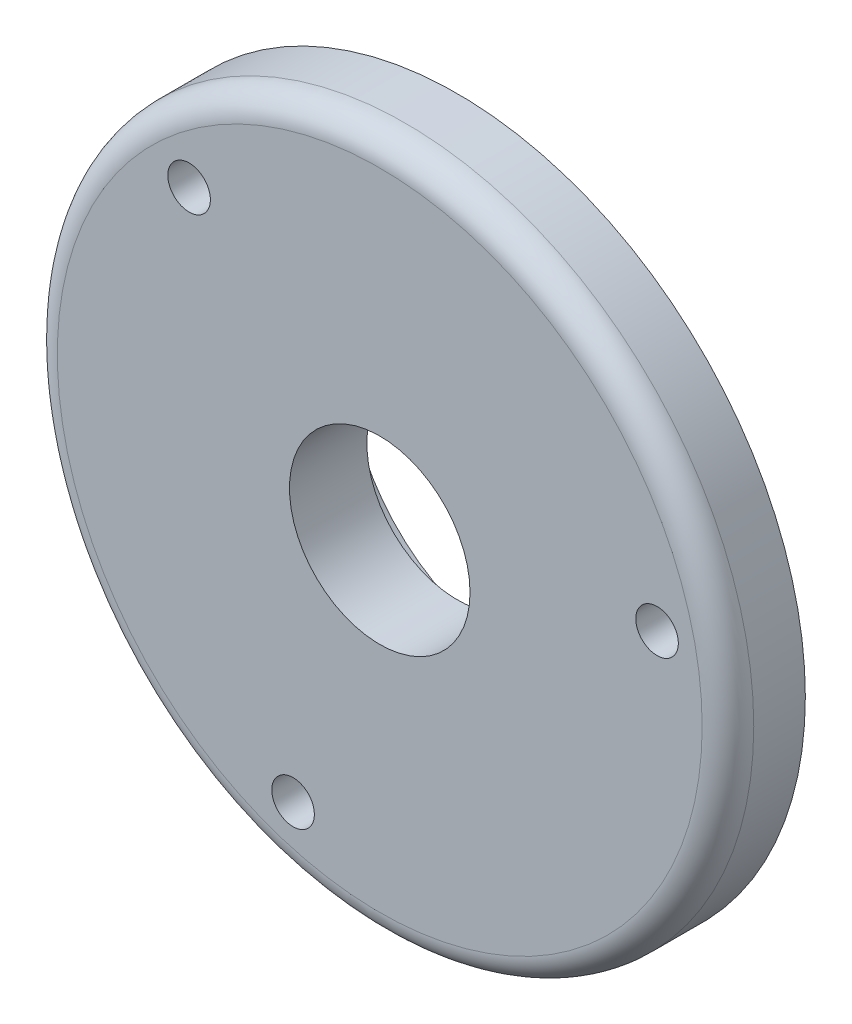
ISO-10303-21;
HEADER;
FILE_DESCRIPTION(('STEP AP214'),'2;1');
FILE_NAME('part.step','',(''),(''),'','','');
FILE_SCHEMA(('AUTOMOTIVE_DESIGN { 1 0 10303 214 1 1 1 1 }'));
ENDSEC;
DATA;
#1=APPLICATION_CONTEXT('core data for automotive mechanical design processes');
#2=APPLICATION_PROTOCOL_DEFINITION('international standard','automotive_design',2000,#1);
#3=PRODUCT_CONTEXT('',#1,'mechanical');
#4=PRODUCT('Part','Part','',(#3));
#5=PRODUCT_RELATED_PRODUCT_CATEGORY('part','',(#4));
#6=PRODUCT_DEFINITION_FORMATION('','',#4);
#7=PRODUCT_DEFINITION_CONTEXT('part definition',#1,'design');
#8=PRODUCT_DEFINITION('design','',#6,#7);
#9=PRODUCT_DEFINITION_SHAPE('','',#8);
#10=(LENGTH_UNIT() NAMED_UNIT(*) SI_UNIT(.MILLI.,.METRE.));
#11=(NAMED_UNIT(*) PLANE_ANGLE_UNIT() SI_UNIT($,.RADIAN.));
#12=(NAMED_UNIT(*) SI_UNIT($,.STERADIAN.) SOLID_ANGLE_UNIT());
#13=UNCERTAINTY_MEASURE_WITH_UNIT(LENGTH_MEASURE(1.E-05),#10,'distance_accuracy_value','');
#14=(GEOMETRIC_REPRESENTATION_CONTEXT(3) GLOBAL_UNCERTAINTY_ASSIGNED_CONTEXT((#13)) GLOBAL_UNIT_ASSIGNED_CONTEXT((#10,
#11,#12)) REPRESENTATION_CONTEXT('',''));
#15=CARTESIAN_POINT('',(0.,0.,0.));
#16=DIRECTION('',(0.,0.,1.));
#17=DIRECTION('',(1.,0.,0.));
#18=AXIS2_PLACEMENT_3D('',#15,#16,#17);
#19=CARTESIAN_POINT('',(0.,0.,57.4974746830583));
#20=DIRECTION('',(0.,0.,-1.));
#21=DIRECTION('',(-1.,0.,0.));
#22=AXIS2_PLACEMENT_3D('',#19,#20,#21);
#23=CYLINDRICAL_SURFACE('',#22,17.5);
#24=CARTESIAN_POINT('',(0.,0.,1.25000000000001));
#25=DIRECTION('',(0.,0.,1.));
#26=DIRECTION('',(1.,0.,0.));
#27=AXIS2_PLACEMENT_3D('',#24,#25,#26);
#28=CIRCLE('',#27,17.5);
#29=CARTESIAN_POINT('',(17.5,0.,1.25000000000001));
#30=VERTEX_POINT('',#29);
#31=EDGE_CURVE('E44',#30,#30,#28,.T.);
#32=ORIENTED_EDGE('',*,*,#31,.T.);
#33=EDGE_LOOP('',(#32));
#34=FACE_BOUND('',#33,.T.);
#35=CARTESIAN_POINT('',(0.,0.,5.99999999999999));
#36=DIRECTION('',(0.,0.,1.));
#37=DIRECTION('',(1.,0.,0.));
#38=AXIS2_PLACEMENT_3D('',#35,#36,#37);
#39=CIRCLE('',#38,17.5);
#40=CARTESIAN_POINT('',(17.5,0.,6.));
#41=VERTEX_POINT('',#40);
#42=EDGE_CURVE('E40',#41,#41,#39,.T.);
#43=ORIENTED_EDGE('',*,*,#42,.F.);
#44=EDGE_LOOP('',(#43));
#45=FACE_BOUND('',#44,.T.);
#46=ADVANCED_FACE('F29',(#34,#45),#23,.T.);
#47=CARTESIAN_POINT('',(0.,0.,1.25000000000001));
#48=DIRECTION('',(0.,0.,1.));
#49=DIRECTION('',(1.,0.,0.));
#50=AXIS2_PLACEMENT_3D('',#47,#48,#49);
#51=PLANE('',#50);
#52=ORIENTED_EDGE('',*,*,#31,.F.);
#53=EDGE_LOOP('',(#52));
#54=FACE_BOUND('',#53,.T.);
#55=CARTESIAN_POINT('',(0.,0.,1.25000000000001));
#56=DIRECTION('',(0.,0.,1.));
#57=DIRECTION('',(1.,0.,0.));
#58=AXIS2_PLACEMENT_3D('',#55,#56,#57);
#59=CIRCLE('',#58,13.204);
#60=CARTESIAN_POINT('',(13.204,0.,1.25000000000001));
#61=VERTEX_POINT('',#60);
#62=EDGE_CURVE('E49',#61,#61,#59,.T.);
#63=ORIENTED_EDGE('',*,*,#62,.T.);
#64=EDGE_LOOP('',(#63));
#65=FACE_BOUND('',#64,.T.);
#66=ADVANCED_FACE('F118',(#54,#65),#51,.F.);
#67=CARTESIAN_POINT('',(0.,0.,57.4974746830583));
#68=DIRECTION('',(0.,0.,-1.));
#69=DIRECTION('',(-1.,0.,0.));
#70=AXIS2_PLACEMENT_3D('',#67,#68,#69);
#71=CYLINDRICAL_SURFACE('',#70,13.204);
#72=ORIENTED_EDGE('',*,*,#62,.F.);
#73=EDGE_LOOP('',(#72));
#74=FACE_BOUND('',#73,.T.);
#75=CARTESIAN_POINT('',(0.,0.,5.99999999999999));
#76=DIRECTION('',(0.,0.,1.));
#77=DIRECTION('',(1.,0.,0.));
#78=AXIS2_PLACEMENT_3D('',#75,#76,#77);
#79=CIRCLE('',#78,13.204);
#80=CARTESIAN_POINT('',(13.204,0.,5.99999999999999));
#81=VERTEX_POINT('',#80);
#82=EDGE_CURVE('E51',#81,#81,#79,.T.);
#83=ORIENTED_EDGE('',*,*,#82,.T.);
#84=EDGE_LOOP('',(#83));
#85=FACE_BOUND('',#84,.T.);
#86=ADVANCED_FACE('F115',(#74,#85),#71,.F.);
#87=CARTESIAN_POINT('',(0.,0.,5.99999999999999));
#88=DIRECTION('',(0.,0.,1.));
#89=DIRECTION('',(1.,0.,0.));
#90=AXIS2_PLACEMENT_3D('',#87,#88,#89);
#91=PLANE('',#90);
#92=CARTESIAN_POINT('',(-6.72018364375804,-20.9484875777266,5.99999999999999));
#93=DIRECTION('',(0.,0.,1.));
#94=DIRECTION('',(1.,0.,0.));
#95=AXIS2_PLACEMENT_3D('',#92,#93,#94);
#96=CIRCLE('',#95,1.64999999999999);
#97=CARTESIAN_POINT('',(-5.07018364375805,-20.9484875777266,5.99999999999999));
#98=VERTEX_POINT('',#97);
#99=EDGE_CURVE('E76',#98,#98,#96,.T.);
#100=ORIENTED_EDGE('',*,*,#99,.T.);
#101=EDGE_LOOP('',(#100));
#102=FACE_BOUND('',#101,.T.);
#103=CARTESIAN_POINT('',(-14.7818305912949,16.2940935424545,5.99999999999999));
#104=DIRECTION('',(0.,0.,1.));
#105=DIRECTION('',(1.,0.,0.));
#106=AXIS2_PLACEMENT_3D('',#103,#104,#105);
#107=CIRCLE('',#106,1.64999999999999);
#108=CARTESIAN_POINT('',(-13.1318305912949,16.2940935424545,5.99999999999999));
#109=VERTEX_POINT('',#108);
#110=EDGE_CURVE('E70',#109,#109,#107,.T.);
#111=ORIENTED_EDGE('',*,*,#110,.T.);
#112=EDGE_LOOP('',(#111));
#113=FACE_BOUND('',#112,.T.);
#114=CARTESIAN_POINT('',(21.502014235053,4.65439403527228,5.99999999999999));
#115=DIRECTION('',(0.,0.,1.));
#116=DIRECTION('',(1.,0.,0.));
#117=AXIS2_PLACEMENT_3D('',#114,#115,#116);
#118=CIRCLE('',#117,1.64999999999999);
#119=CARTESIAN_POINT('',(23.152014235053,4.65439403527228,5.99999999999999));
#120=VERTEX_POINT('',#119);
#121=EDGE_CURVE('E62',#120,#120,#118,.T.);
#122=ORIENTED_EDGE('',*,*,#121,.T.);
#123=EDGE_LOOP('',(#122));
#124=FACE_BOUND('',#123,.T.);
#125=CARTESIAN_POINT('',(0.,0.,5.99999999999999));
#126=DIRECTION('',(0.,0.,1.));
#127=DIRECTION('',(1.,0.,0.));
#128=AXIS2_PLACEMENT_3D('',#125,#126,#127);
#129=CIRCLE('',#128,27.);
#130=CARTESIAN_POINT('',(27.,0.,5.99999999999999));
#131=VERTEX_POINT('',#130);
#132=EDGE_CURVE('E55',#131,#131,#129,.T.);
#133=ORIENTED_EDGE('',*,*,#132,.F.);
#134=EDGE_LOOP('',(#133));
#135=FACE_BOUND('',#134,.T.);
#136=ORIENTED_EDGE('',*,*,#42,.T.);
#137=EDGE_LOOP('',(#136));
#138=FACE_BOUND('',#137,.T.);
#139=ADVANCED_FACE('F90',(#102,#113,#124,#135,#138),#91,.F.);
#140=CARTESIAN_POINT('',(0.,0.,12.));
#141=DIRECTION('',(0.,0.,1.));
#142=DIRECTION('',(1.,0.,0.));
#143=AXIS2_PLACEMENT_3D('',#140,#141,#142);
#144=PLANE('',#143);
#145=CARTESIAN_POINT('',(0.,0.,12.));
#146=DIRECTION('',(0.,0.,1.));
#147=DIRECTION('',(1.,0.,0.));
#148=AXIS2_PLACEMENT_3D('',#145,#146,#147);
#149=CIRCLE('',#148,25.);
#150=CARTESIAN_POINT('',(25.,0.,12.));
#151=VERTEX_POINT('',#150);
#152=EDGE_CURVE('E36',#151,#151,#149,.T.);
#153=ORIENTED_EDGE('',*,*,#152,.T.);
#154=EDGE_LOOP('',(#153));
#155=FACE_BOUND('',#154,.T.);
#156=CARTESIAN_POINT('',(-6.72018364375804,-20.9484875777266,12.));
#157=DIRECTION('',(0.,0.,1.));
#158=DIRECTION('',(1.,0.,0.));
#159=AXIS2_PLACEMENT_3D('',#156,#157,#158);
#160=CIRCLE('',#159,1.64999999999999);
#161=CARTESIAN_POINT('',(-5.07018364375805,-20.9484875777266,12.));
#162=VERTEX_POINT('',#161);
#163=EDGE_CURVE('E79',#162,#162,#160,.T.);
#164=ORIENTED_EDGE('',*,*,#163,.F.);
#165=EDGE_LOOP('',(#164));
#166=FACE_BOUND('',#165,.T.);
#167=CARTESIAN_POINT('',(-14.7818305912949,16.2940935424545,12.));
#168=DIRECTION('',(0.,0.,1.));
#169=DIRECTION('',(1.,0.,0.));
#170=AXIS2_PLACEMENT_3D('',#167,#168,#169);
#171=CIRCLE('',#170,1.64999999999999);
#172=CARTESIAN_POINT('',(-13.1318305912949,16.2940935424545,12.));
#173=VERTEX_POINT('',#172);
#174=EDGE_CURVE('E73',#173,#173,#171,.T.);
#175=ORIENTED_EDGE('',*,*,#174,.F.);
#176=EDGE_LOOP('',(#175));
#177=FACE_BOUND('',#176,.T.);
#178=CARTESIAN_POINT('',(21.502014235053,4.65439403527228,12.));
#179=DIRECTION('',(0.,0.,1.));
#180=DIRECTION('',(1.,0.,0.));
#181=AXIS2_PLACEMENT_3D('',#178,#179,#180);
#182=CIRCLE('',#181,1.64999999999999);
#183=CARTESIAN_POINT('',(23.152014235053,4.65439403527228,12.));
#184=VERTEX_POINT('',#183);
#185=EDGE_CURVE('E67',#184,#184,#182,.T.);
#186=ORIENTED_EDGE('',*,*,#185,.F.);
#187=EDGE_LOOP('',(#186));
#188=FACE_BOUND('',#187,.T.);
#189=CARTESIAN_POINT('',(0.,0.,12.));
#190=DIRECTION('',(0.,0.,1.));
#191=DIRECTION('',(1.,0.,0.));
#192=AXIS2_PLACEMENT_3D('',#189,#190,#191);
#193=CIRCLE('',#192,7.);
#194=CARTESIAN_POINT('',(7.,0.,12.));
#195=VERTEX_POINT('',#194);
#196=EDGE_CURVE('E58',#195,#195,#193,.T.);
#197=ORIENTED_EDGE('',*,*,#196,.F.);
#198=EDGE_LOOP('',(#197));
#199=FACE_BOUND('',#198,.T.);
#200=ADVANCED_FACE('F86',(#155,#166,#177,#188,#199),#144,.T.);
#201=ORIENTED_EDGE('',*,*,#82,.F.);
#202=EDGE_LOOP('',(#201));
#203=FACE_BOUND('',#202,.T.);
#204=CARTESIAN_POINT('',(0.,0.,5.99999999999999));
#205=DIRECTION('',(0.,0.,1.));
#206=DIRECTION('',(1.,0.,0.));
#207=AXIS2_PLACEMENT_3D('',#204,#205,#206);
#208=CIRCLE('',#207,7.);
#209=CARTESIAN_POINT('',(7.,0.,5.99999999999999));
#210=VERTEX_POINT('',#209);
#211=EDGE_CURVE('E59',#210,#210,#208,.T.);
#212=ORIENTED_EDGE('',*,*,#211,.T.);
#213=EDGE_LOOP('',(#212));
#214=FACE_BOUND('',#213,.T.);
#215=ADVANCED_FACE('F89',(#203,#214),#91,.F.);
#216=CARTESIAN_POINT('',(0.,0.,12.));
#217=DIRECTION('',(0.,0.,-1.));
#218=DIRECTION('',(-1.,0.,0.));
#219=AXIS2_PLACEMENT_3D('',#216,#217,#218);
#220=CYLINDRICAL_SURFACE('',#219,27.);
#221=CARTESIAN_POINT('',(0.,0.,9.99999999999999));
#222=DIRECTION('',(0.,0.,1.));
#223=DIRECTION('',(1.,0.,0.));
#224=AXIS2_PLACEMENT_3D('',#221,#222,#223);
#225=CIRCLE('',#224,27.);
#226=CARTESIAN_POINT('',(27.,0.,9.99999999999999));
#227=VERTEX_POINT('',#226);
#228=EDGE_CURVE('E10',#227,#227,#225,.F.);
#229=ORIENTED_EDGE('',*,*,#228,.T.);
#230=EDGE_LOOP('',(#229));
#231=FACE_BOUND('',#230,.T.);
#232=ORIENTED_EDGE('',*,*,#132,.T.);
#233=EDGE_LOOP('',(#232));
#234=FACE_BOUND('',#233,.T.);
#235=ADVANCED_FACE('F102',(#231,#234),#220,.T.);
#236=CARTESIAN_POINT('',(0.,0.,12.));
#237=DIRECTION('',(0.,0.,-1.));
#238=DIRECTION('',(-1.,0.,0.));
#239=AXIS2_PLACEMENT_3D('',#236,#237,#238);
#240=CYLINDRICAL_SURFACE('',#239,7.);
#241=ORIENTED_EDGE('',*,*,#196,.T.);
#242=EDGE_LOOP('',(#241));
#243=FACE_BOUND('',#242,.T.);
#244=ORIENTED_EDGE('',*,*,#211,.F.);
#245=EDGE_LOOP('',(#244));
#246=FACE_BOUND('',#245,.T.);
#247=ADVANCED_FACE('F98',(#243,#246),#240,.F.);
#248=CARTESIAN_POINT('',(21.502014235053,4.65439403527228,12.));
#249=DIRECTION('',(0.,0.,1.));
#250=DIRECTION('',(1.,0.,0.));
#251=AXIS2_PLACEMENT_3D('',#248,#249,#250);
#252=CYLINDRICAL_SURFACE('',#251,1.64999999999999);
#253=ORIENTED_EDGE('',*,*,#185,.T.);
#254=EDGE_LOOP('',(#253));
#255=FACE_BOUND('',#254,.T.);
#256=ORIENTED_EDGE('',*,*,#121,.F.);
#257=EDGE_LOOP('',(#256));
#258=FACE_BOUND('',#257,.T.);
#259=ADVANCED_FACE('F101',(#255,#258),#252,.F.);
#260=CARTESIAN_POINT('',(-14.7818305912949,16.2940935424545,12.));
#261=DIRECTION('',(0.,0.,1.));
#262=DIRECTION('',(1.,0.,0.));
#263=AXIS2_PLACEMENT_3D('',#260,#261,#262);
#264=CYLINDRICAL_SURFACE('',#263,1.64999999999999);
#265=ORIENTED_EDGE('',*,*,#174,.T.);
#266=EDGE_LOOP('',(#265));
#267=FACE_BOUND('',#266,.T.);
#268=ORIENTED_EDGE('',*,*,#110,.F.);
#269=EDGE_LOOP('',(#268));
#270=FACE_BOUND('',#269,.T.);
#271=ADVANCED_FACE('F173',(#267,#270),#264,.F.);
#272=CARTESIAN_POINT('',(-6.72018364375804,-20.9484875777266,12.));
#273=DIRECTION('',(0.,0.,1.));
#274=DIRECTION('',(1.,0.,0.));
#275=AXIS2_PLACEMENT_3D('',#272,#273,#274);
#276=CYLINDRICAL_SURFACE('',#275,1.64999999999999);
#277=ORIENTED_EDGE('',*,*,#163,.T.);
#278=EDGE_LOOP('',(#277));
#279=FACE_BOUND('',#278,.T.);
#280=ORIENTED_EDGE('',*,*,#99,.F.);
#281=EDGE_LOOP('',(#280));
#282=FACE_BOUND('',#281,.T.);
#283=ADVANCED_FACE('F83',(#279,#282),#276,.F.);
#284=CARTESIAN_POINT('',(0.,0.,9.99999999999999));
#285=DIRECTION('',(0.,0.,1.));
#286=DIRECTION('',(1.,0.,0.));
#287=AXIS2_PLACEMENT_3D('',#284,#285,#286);
#288=TOROIDAL_SURFACE('',#287,25.,2.);
#289=ORIENTED_EDGE('',*,*,#228,.F.);
#290=EDGE_LOOP('',(#289));
#291=FACE_BOUND('',#290,.T.);
#292=ORIENTED_EDGE('',*,*,#152,.F.);
#293=EDGE_LOOP('',(#292));
#294=FACE_BOUND('',#293,.T.);
#295=ADVANCED_FACE('F31',(#291,#294),#288,.T.);
#296=CLOSED_SHELL('',(#46,#66,#86,#139,#200,#215,#235,#247,#259,#271,#283,#295));
#297=MANIFOLD_SOLID_BREP('B2',#296);
#298=ADVANCED_BREP_SHAPE_REPRESENTATION('',(#18,#297),#14);
#299=SHAPE_DEFINITION_REPRESENTATION(#9,#298);
ENDSEC;
END-ISO-10303-21;
